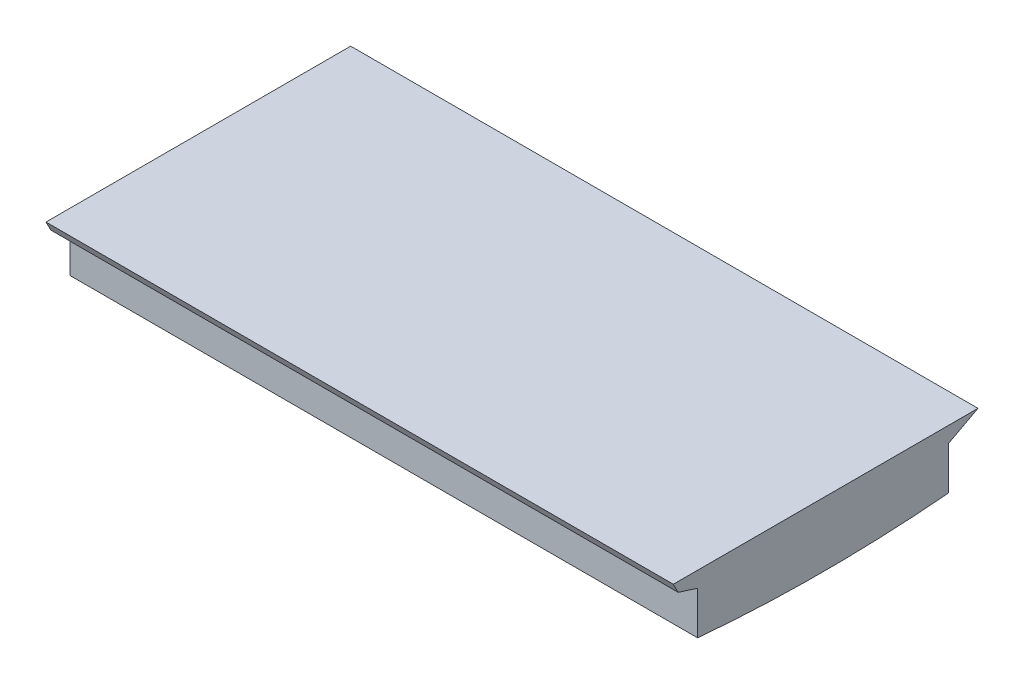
from build123d import *

# Parameters (mm, degrees)
SKETCH1_W          = 12
SKETCH1_H          = 2.05
EXTRUDE1_DEPTH     = 15
EXTRUDE2_DEPTH     = 15
CUT_EXTRUDE1_DEPTH = 32.17976673
EXTRUDE3_DEPTH     = 30


with BuildPart() as part:
    # Sketch1 → Extrude1 (new, symmetric)
    with BuildSketch(Plane(origin=(0, 0, 0), x_dir=(0, 0, -1), z_dir=(1, 0, 0))):
        Rectangle(SKETCH1_W, SKETCH1_H)
    extrude(amount=EXTRUDE1_DEPTH, both=True)

    # Sketch2 → Extrude2 (add, symmetric)
    with BuildSketch(Plane(origin=(0, 0, 0), x_dir=(0, 0, -1), z_dir=(1, 0, 0))):
        Polygon((-8.308262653, 1.775), (7.410544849, 1.775), (6, 1.025), (-6, 1.025), align=None)
    extrude(amount=EXTRUDE2_DEPTH, both=True)

    # Sketch3 → Cut-Extrude1 (cut, through all)
    with BuildSketch(Plane(origin=(15, 0, 0), x_dir=(0, 0, -1), z_dir=(1, 0, 0))):
        Polygon((-8.308262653, 1.775), (-6.929230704, 1.326925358), (-7.158262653, 1.775), align=None)
    extrude(amount=-CUT_EXTRUDE1_DEPTH, mode=Mode.SUBTRACT)

    # Sketch4 → Extrude3 (add)
    with BuildSketch(Plane(origin=(15, 0, 0), x_dir=(0, 0, -1), z_dir=(1, 0, 0))):
        with BuildLine():
            Line((-6, -1.025), (6, -1.025))
            ThreePointArc((6, -1.025), (0, -1.292195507), (-6, -1.025))
        make_face()
    extrude(amount=-EXTRUDE3_DEPTH)


solid = part.part
